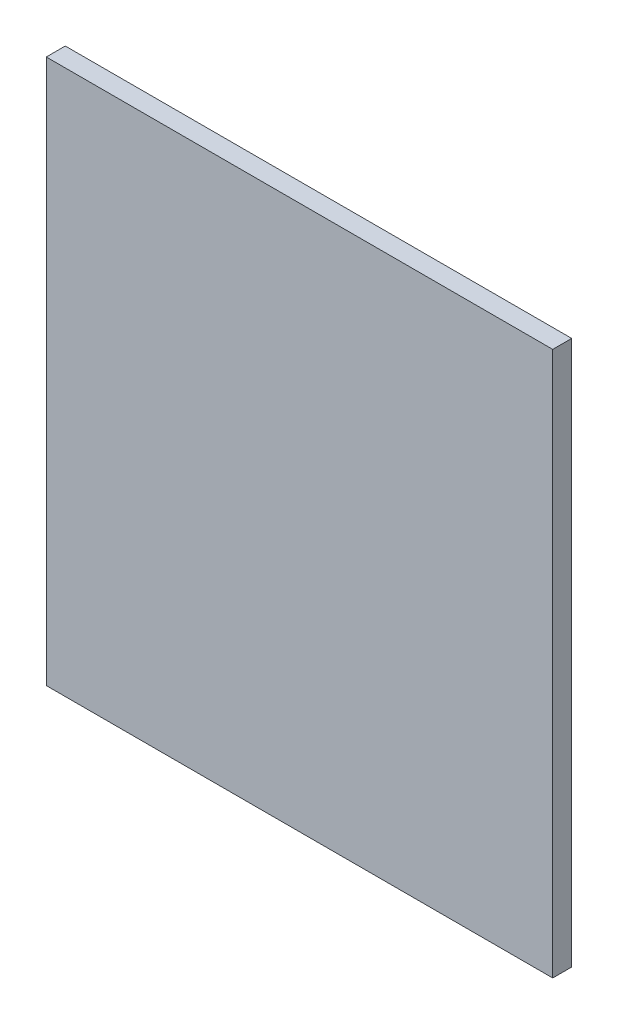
from build123d import *

# Parameters (mm, degrees)
CROQUIS1_W              = 400
CROQUIS1_H              = 430
SALIENTE_EXTRUIR1_DEPTH = 15


with BuildPart() as part:
    # Croquis1 → Saliente-Extruir1 (new body)
    with BuildSketch(Plane.XY):
        Rectangle(CROQUIS1_W, CROQUIS1_H)
    extrude(amount=SALIENTE_EXTRUIR1_DEPTH)


solid = part.part
